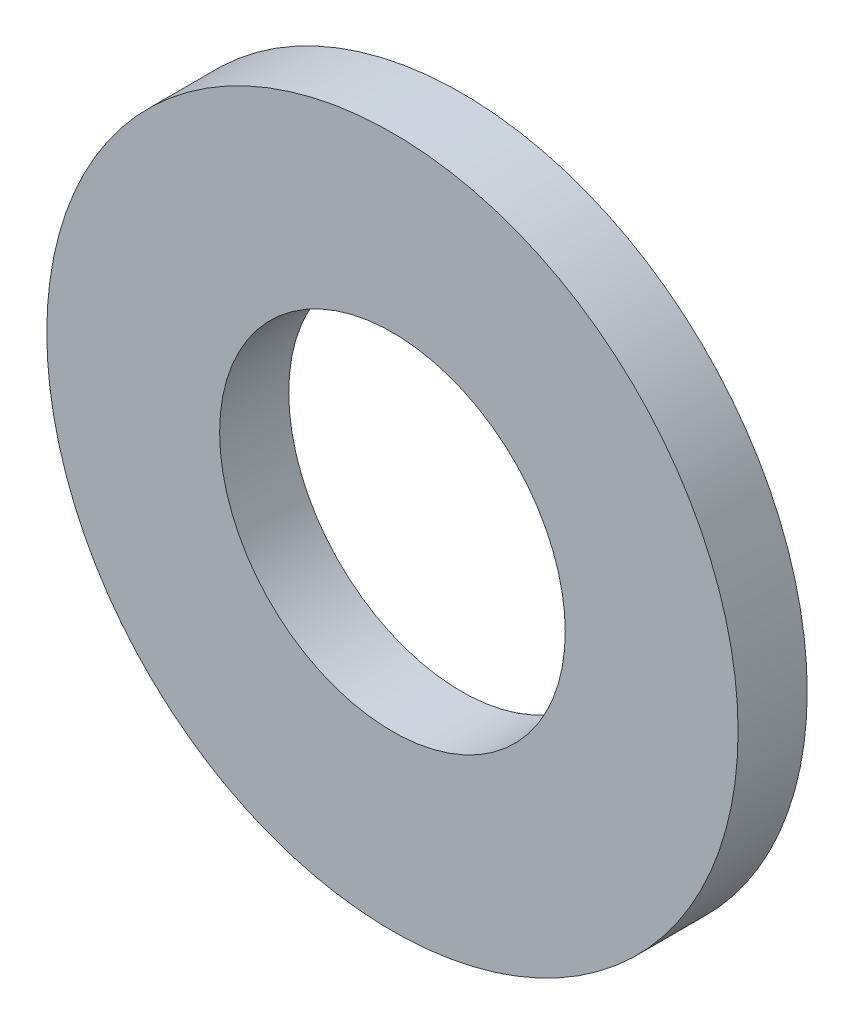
from build123d import *

# Parameters (mm, degrees)
ESQUISSE1_R      = 12.5
ESQUISSE1_R_2    = 6.25
EXTRUSION1_DEPTH = 2.5


with BuildPart() as part:
    # Esquisse1 → Extrusion1 (new body)
    with BuildSketch(Plane.XY):
        Circle(ESQUISSE1_R)
        Circle(ESQUISSE1_R_2, mode=Mode.SUBTRACT)
    extrude(amount=EXTRUSION1_DEPTH)


solid = part.part
